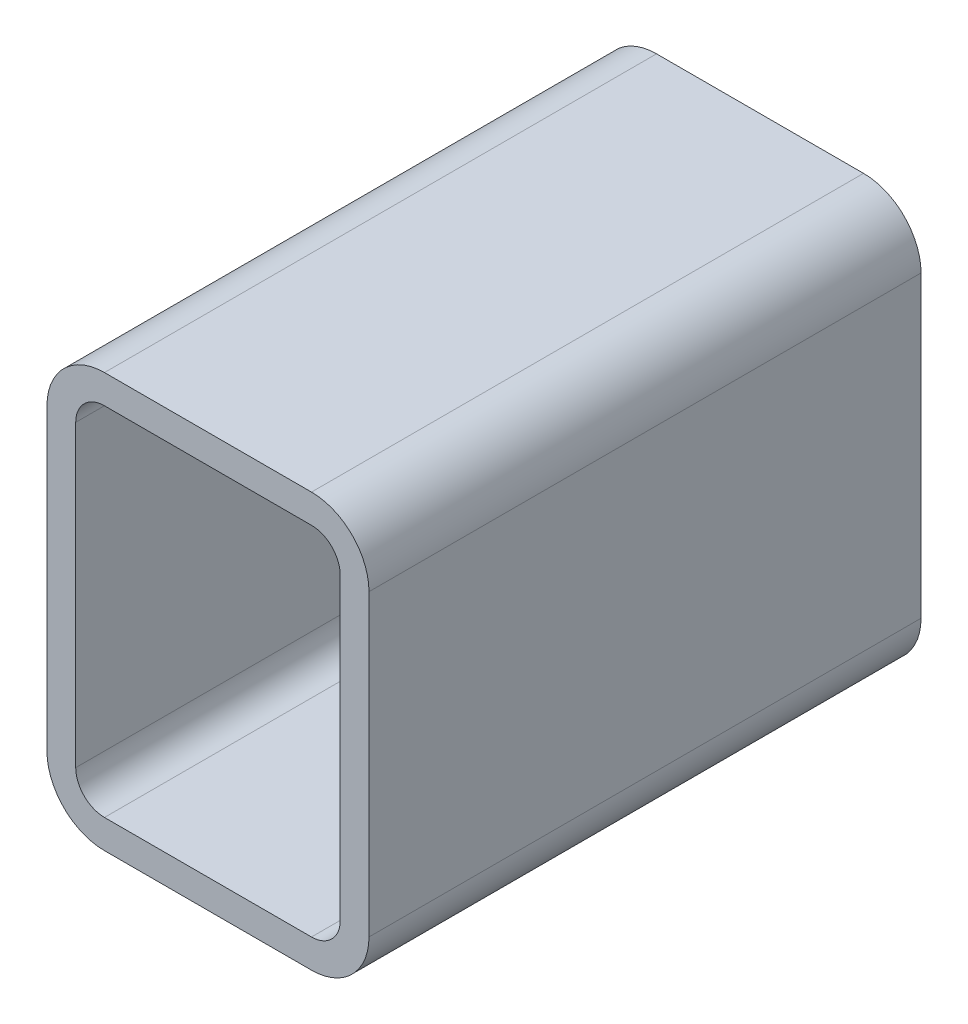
ISO-10303-21;
HEADER;
FILE_DESCRIPTION(('STEP AP214'),'2;1');
FILE_NAME('part.step','',(''),(''),'','','');
FILE_SCHEMA(('AUTOMOTIVE_DESIGN { 1 0 10303 214 1 1 1 1 }'));
ENDSEC;
DATA;
#1=APPLICATION_CONTEXT('core data for automotive mechanical design processes');
#2=APPLICATION_PROTOCOL_DEFINITION('international standard','automotive_design',2000,#1);
#3=PRODUCT_CONTEXT('',#1,'mechanical');
#4=PRODUCT('Part','Part','',(#3));
#5=PRODUCT_RELATED_PRODUCT_CATEGORY('part','',(#4));
#6=PRODUCT_DEFINITION_FORMATION('','',#4);
#7=PRODUCT_DEFINITION_CONTEXT('part definition',#1,'design');
#8=PRODUCT_DEFINITION('design','',#6,#7);
#9=PRODUCT_DEFINITION_SHAPE('','',#8);
#10=(LENGTH_UNIT() NAMED_UNIT(*) SI_UNIT(.MILLI.,.METRE.));
#11=(NAMED_UNIT(*) PLANE_ANGLE_UNIT() SI_UNIT($,.RADIAN.));
#12=(NAMED_UNIT(*) SI_UNIT($,.STERADIAN.) SOLID_ANGLE_UNIT());
#13=UNCERTAINTY_MEASURE_WITH_UNIT(LENGTH_MEASURE(1.E-05),#10,'distance_accuracy_value','');
#14=(GEOMETRIC_REPRESENTATION_CONTEXT(3) GLOBAL_UNCERTAINTY_ASSIGNED_CONTEXT((#13)) GLOBAL_UNIT_ASSIGNED_CONTEXT((#10,
#11,#12)) REPRESENTATION_CONTEXT('',''));
#15=CARTESIAN_POINT('',(0.,0.,0.));
#16=DIRECTION('',(0.,0.,1.));
#17=DIRECTION('',(1.,0.,0.));
#18=AXIS2_PLACEMENT_3D('',#15,#16,#17);
#19=CARTESIAN_POINT('',(33.9548786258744,198.793222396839,304.8));
#20=DIRECTION('',(0.,0.,1.));
#21=DIRECTION('',(1.,0.,0.));
#22=AXIS2_PLACEMENT_3D('',#19,#20,#21);
#23=PLANE('',#22);
#24=CARTESIAN_POINT('',(33.9548786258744,198.793222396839,304.8));
#25=DIRECTION('',(0.,0.,1.));
#26=DIRECTION('',(1.,0.,0.));
#27=AXIS2_PLACEMENT_3D('',#24,#25,#26);
#28=CIRCLE('',#27,31.75);
#29=CARTESIAN_POINT('',(33.9548786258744,230.543222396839,304.8));
#30=VERTEX_POINT('',#29);
#31=CARTESIAN_POINT('',(2.20487862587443,198.793222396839,304.8));
#32=VERTEX_POINT('',#31);
#33=EDGE_CURVE('E211',#30,#32,#28,.T.);
#34=ORIENTED_EDGE('',*,*,#33,.T.);
#35=DIRECTION('',(0.,-1.,0.));
#36=VECTOR('',#35,1.);
#37=CARTESIAN_POINT('',(2.20487862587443,33.6932223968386,304.8));
#38=LINE('',#37,#36);
#39=CARTESIAN_POINT('',(2.20487862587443,33.6932223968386,304.8));
#40=VERTEX_POINT('',#39);
#41=EDGE_CURVE('E214',#32,#40,#38,.T.);
#42=ORIENTED_EDGE('',*,*,#41,.T.);
#43=CARTESIAN_POINT('',(33.9548786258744,33.6932223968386,304.8));
#44=DIRECTION('',(0.,0.,1.));
#45=DIRECTION('',(1.,0.,0.));
#46=AXIS2_PLACEMENT_3D('',#43,#44,#45);
#47=CIRCLE('',#46,31.75);
#48=CARTESIAN_POINT('',(33.9548786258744,1.94322239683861,304.8));
#49=VERTEX_POINT('',#48);
#50=EDGE_CURVE('E217',#40,#49,#47,.T.);
#51=ORIENTED_EDGE('',*,*,#50,.T.);
#52=DIRECTION('',(1.,0.,0.));
#53=VECTOR('',#52,1.);
#54=CARTESIAN_POINT('',(148.254878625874,1.94322239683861,304.8));
#55=LINE('',#54,#53);
#56=CARTESIAN_POINT('',(148.254878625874,1.9432223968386,304.8));
#57=VERTEX_POINT('',#56);
#58=EDGE_CURVE('E219',#49,#57,#55,.T.);
#59=ORIENTED_EDGE('',*,*,#58,.T.);
#60=CARTESIAN_POINT('',(148.254878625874,33.6932223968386,304.8));
#61=DIRECTION('',(0.,0.,1.));
#62=DIRECTION('',(1.,0.,0.));
#63=AXIS2_PLACEMENT_3D('',#60,#61,#62);
#64=CIRCLE('',#63,31.75);
#65=CARTESIAN_POINT('',(180.004878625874,33.6932223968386,304.8));
#66=VERTEX_POINT('',#65);
#67=EDGE_CURVE('E221',#57,#66,#64,.T.);
#68=ORIENTED_EDGE('',*,*,#67,.T.);
#69=DIRECTION('',(0.,1.,0.));
#70=VECTOR('',#69,1.);
#71=CARTESIAN_POINT('',(180.004878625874,198.793222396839,304.8));
#72=LINE('',#71,#70);
#73=CARTESIAN_POINT('',(180.004878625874,198.793222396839,304.8));
#74=VERTEX_POINT('',#73);
#75=EDGE_CURVE('E223',#66,#74,#72,.T.);
#76=ORIENTED_EDGE('',*,*,#75,.T.);
#77=CARTESIAN_POINT('',(148.254878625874,198.793222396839,304.8));
#78=DIRECTION('',(0.,0.,1.));
#79=DIRECTION('',(1.,0.,0.));
#80=AXIS2_PLACEMENT_3D('',#77,#78,#79);
#81=CIRCLE('',#80,31.75);
#82=CARTESIAN_POINT('',(148.254878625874,230.543222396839,304.8));
#83=VERTEX_POINT('',#82);
#84=EDGE_CURVE('E225',#74,#83,#81,.T.);
#85=ORIENTED_EDGE('',*,*,#84,.T.);
#86=DIRECTION('',(-1.,0.,0.));
#87=VECTOR('',#86,1.);
#88=CARTESIAN_POINT('',(33.9548786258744,230.543222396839,304.8));
#89=LINE('',#88,#87);
#90=EDGE_CURVE('E227',#83,#30,#89,.T.);
#91=ORIENTED_EDGE('',*,*,#90,.T.);
#92=EDGE_LOOP('',(#34,#42,#51,#59,#68,#76,#85,#91));
#93=FACE_BOUND('',#92,.T.);
#94=DIRECTION('',(0.,-1.,0.));
#95=VECTOR('',#94,1.);
#96=CARTESIAN_POINT('',(18.0798786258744,33.6932223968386,304.8));
#97=LINE('',#96,#95);
#98=CARTESIAN_POINT('',(18.0798786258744,198.793222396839,304.8));
#99=VERTEX_POINT('',#98);
#100=CARTESIAN_POINT('',(18.0798786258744,33.6932223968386,304.8));
#101=VERTEX_POINT('',#100);
#102=EDGE_CURVE('E154',#99,#101,#97,.T.);
#103=ORIENTED_EDGE('',*,*,#102,.F.);
#104=CARTESIAN_POINT('',(33.9548786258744,198.793222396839,304.8));
#105=DIRECTION('',(0.,0.,1.));
#106=DIRECTION('',(1.,0.,0.));
#107=AXIS2_PLACEMENT_3D('',#104,#105,#106);
#108=CIRCLE('',#107,15.875);
#109=CARTESIAN_POINT('',(33.9548786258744,214.668222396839,304.8));
#110=VERTEX_POINT('',#109);
#111=EDGE_CURVE('E146',#110,#99,#108,.T.);
#112=ORIENTED_EDGE('',*,*,#111,.F.);
#113=DIRECTION('',(-1.,0.,0.));
#114=VECTOR('',#113,1.);
#115=CARTESIAN_POINT('',(33.9548786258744,214.668222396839,304.8));
#116=LINE('',#115,#114);
#117=CARTESIAN_POINT('',(148.254878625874,214.668222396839,304.8));
#118=VERTEX_POINT('',#117);
#119=EDGE_CURVE('E179',#118,#110,#116,.T.);
#120=ORIENTED_EDGE('',*,*,#119,.F.);
#121=CARTESIAN_POINT('',(148.254878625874,198.793222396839,304.8));
#122=DIRECTION('',(0.,0.,1.));
#123=DIRECTION('',(1.,0.,0.));
#124=AXIS2_PLACEMENT_3D('',#121,#122,#123);
#125=CIRCLE('',#124,15.875);
#126=CARTESIAN_POINT('',(164.129878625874,198.793222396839,304.8));
#127=VERTEX_POINT('',#126);
#128=EDGE_CURVE('E177',#127,#118,#125,.T.);
#129=ORIENTED_EDGE('',*,*,#128,.F.);
#130=DIRECTION('',(0.,1.,0.));
#131=VECTOR('',#130,1.);
#132=CARTESIAN_POINT('',(164.129878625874,198.793222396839,304.8));
#133=LINE('',#132,#131);
#134=CARTESIAN_POINT('',(164.129878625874,33.6932223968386,304.8));
#135=VERTEX_POINT('',#134);
#136=EDGE_CURVE('E175',#135,#127,#133,.T.);
#137=ORIENTED_EDGE('',*,*,#136,.F.);
#138=CARTESIAN_POINT('',(148.254878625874,33.6932223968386,304.8));
#139=DIRECTION('',(0.,0.,1.));
#140=DIRECTION('',(1.,0.,0.));
#141=AXIS2_PLACEMENT_3D('',#138,#139,#140);
#142=CIRCLE('',#141,15.875);
#143=CARTESIAN_POINT('',(148.254878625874,17.8182223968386,304.8));
#144=VERTEX_POINT('',#143);
#145=EDGE_CURVE('E173',#144,#135,#142,.T.);
#146=ORIENTED_EDGE('',*,*,#145,.F.);
#147=DIRECTION('',(1.,0.,0.));
#148=VECTOR('',#147,1.);
#149=CARTESIAN_POINT('',(148.254878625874,17.8182223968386,304.8));
#150=LINE('',#149,#148);
#151=CARTESIAN_POINT('',(33.9548786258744,17.8182223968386,304.8));
#152=VERTEX_POINT('',#151);
#153=EDGE_CURVE('E169',#152,#144,#150,.T.);
#154=ORIENTED_EDGE('',*,*,#153,.F.);
#155=CARTESIAN_POINT('',(33.9548786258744,33.6932223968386,304.8));
#156=DIRECTION('',(0.,0.,1.));
#157=DIRECTION('',(1.,0.,0.));
#158=AXIS2_PLACEMENT_3D('',#155,#156,#157);
#159=CIRCLE('',#158,15.875);
#160=EDGE_CURVE('E167',#101,#152,#159,.T.);
#161=ORIENTED_EDGE('',*,*,#160,.F.);
#162=EDGE_LOOP('',(#103,#112,#120,#129,#137,#146,#154,#161));
#163=FACE_BOUND('',#162,.T.);
#164=ADVANCED_FACE('F33',(#93,#163),#23,.T.);
#165=CARTESIAN_POINT('',(33.9548786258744,198.793222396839,0.));
#166=DIRECTION('',(0.,0.,1.));
#167=DIRECTION('',(1.,0.,0.));
#168=AXIS2_PLACEMENT_3D('',#165,#166,#167);
#169=PLANE('',#168);
#170=CARTESIAN_POINT('',(33.9548786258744,198.793222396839,0.));
#171=DIRECTION('',(0.,0.,1.));
#172=DIRECTION('',(1.,0.,0.));
#173=AXIS2_PLACEMENT_3D('',#170,#171,#172);
#174=CIRCLE('',#173,31.75);
#175=CARTESIAN_POINT('',(33.9548786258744,230.543222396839,0.));
#176=VERTEX_POINT('',#175);
#177=CARTESIAN_POINT('',(2.20487862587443,198.793222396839,0.));
#178=VERTEX_POINT('',#177);
#179=EDGE_CURVE('E162',#176,#178,#174,.T.);
#180=ORIENTED_EDGE('',*,*,#179,.F.);
#181=DIRECTION('',(-1.,0.,0.));
#182=VECTOR('',#181,1.);
#183=CARTESIAN_POINT('',(33.9548786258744,230.543222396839,0.));
#184=LINE('',#183,#182);
#185=CARTESIAN_POINT('',(148.254878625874,230.543222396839,0.));
#186=VERTEX_POINT('',#185);
#187=EDGE_CURVE('E215',#186,#176,#184,.T.);
#188=ORIENTED_EDGE('',*,*,#187,.F.);
#189=CARTESIAN_POINT('',(148.254878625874,198.793222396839,0.));
#190=DIRECTION('',(0.,0.,1.));
#191=DIRECTION('',(1.,0.,0.));
#192=AXIS2_PLACEMENT_3D('',#189,#190,#191);
#193=CIRCLE('',#192,31.75);
#194=CARTESIAN_POINT('',(180.004878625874,198.793222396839,0.));
#195=VERTEX_POINT('',#194);
#196=EDGE_CURVE('E242',#195,#186,#193,.T.);
#197=ORIENTED_EDGE('',*,*,#196,.F.);
#198=DIRECTION('',(0.,1.,0.));
#199=VECTOR('',#198,1.);
#200=CARTESIAN_POINT('',(180.004878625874,198.793222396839,0.));
#201=LINE('',#200,#199);
#202=CARTESIAN_POINT('',(180.004878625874,33.6932223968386,0.));
#203=VERTEX_POINT('',#202);
#204=EDGE_CURVE('E240',#203,#195,#201,.T.);
#205=ORIENTED_EDGE('',*,*,#204,.F.);
#206=CARTESIAN_POINT('',(148.254878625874,33.6932223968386,0.));
#207=DIRECTION('',(0.,0.,1.));
#208=DIRECTION('',(1.,0.,0.));
#209=AXIS2_PLACEMENT_3D('',#206,#207,#208);
#210=CIRCLE('',#209,31.75);
#211=CARTESIAN_POINT('',(148.254878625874,1.9432223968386,0.));
#212=VERTEX_POINT('',#211);
#213=EDGE_CURVE('E238',#212,#203,#210,.T.);
#214=ORIENTED_EDGE('',*,*,#213,.F.);
#215=DIRECTION('',(1.,0.,0.));
#216=VECTOR('',#215,1.);
#217=CARTESIAN_POINT('',(148.254878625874,1.94322239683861,0.));
#218=LINE('',#217,#216);
#219=CARTESIAN_POINT('',(33.9548786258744,1.94322239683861,0.));
#220=VERTEX_POINT('',#219);
#221=EDGE_CURVE('E236',#220,#212,#218,.T.);
#222=ORIENTED_EDGE('',*,*,#221,.F.);
#223=CARTESIAN_POINT('',(33.9548786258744,33.6932223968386,0.));
#224=DIRECTION('',(0.,0.,1.));
#225=DIRECTION('',(1.,0.,0.));
#226=AXIS2_PLACEMENT_3D('',#223,#224,#225);
#227=CIRCLE('',#226,31.75);
#228=CARTESIAN_POINT('',(2.20487862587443,33.6932223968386,0.));
#229=VERTEX_POINT('',#228);
#230=EDGE_CURVE('E234',#229,#220,#227,.T.);
#231=ORIENTED_EDGE('',*,*,#230,.F.);
#232=DIRECTION('',(0.,-1.,0.));
#233=VECTOR('',#232,1.);
#234=CARTESIAN_POINT('',(2.20487862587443,33.6932223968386,0.));
#235=LINE('',#234,#233);
#236=EDGE_CURVE('E232',#178,#229,#235,.T.);
#237=ORIENTED_EDGE('',*,*,#236,.F.);
#238=EDGE_LOOP('',(#180,#188,#197,#205,#214,#222,#231,#237));
#239=FACE_BOUND('',#238,.T.);
#240=CARTESIAN_POINT('',(33.9548786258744,198.793222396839,0.));
#241=DIRECTION('',(0.,0.,1.));
#242=DIRECTION('',(1.,0.,0.));
#243=AXIS2_PLACEMENT_3D('',#240,#241,#242);
#244=CIRCLE('',#243,15.875);
#245=CARTESIAN_POINT('',(33.9548786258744,214.668222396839,0.));
#246=VERTEX_POINT('',#245);
#247=CARTESIAN_POINT('',(18.0798786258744,198.793222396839,0.));
#248=VERTEX_POINT('',#247);
#249=EDGE_CURVE('E56',#246,#248,#244,.T.);
#250=ORIENTED_EDGE('',*,*,#249,.T.);
#251=DIRECTION('',(0.,-1.,0.));
#252=VECTOR('',#251,1.);
#253=CARTESIAN_POINT('',(18.0798786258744,33.6932223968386,0.));
#254=LINE('',#253,#252);
#255=CARTESIAN_POINT('',(18.0798786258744,33.6932223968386,0.));
#256=VERTEX_POINT('',#255);
#257=EDGE_CURVE('E161',#248,#256,#254,.T.);
#258=ORIENTED_EDGE('',*,*,#257,.T.);
#259=CARTESIAN_POINT('',(33.9548786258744,33.6932223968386,0.));
#260=DIRECTION('',(0.,0.,1.));
#261=DIRECTION('',(1.,0.,0.));
#262=AXIS2_PLACEMENT_3D('',#259,#260,#261);
#263=CIRCLE('',#262,15.875);
#264=CARTESIAN_POINT('',(33.9548786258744,17.8182223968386,0.));
#265=VERTEX_POINT('',#264);
#266=EDGE_CURVE('E183',#256,#265,#263,.T.);
#267=ORIENTED_EDGE('',*,*,#266,.T.);
#268=DIRECTION('',(1.,0.,0.));
#269=VECTOR('',#268,1.);
#270=CARTESIAN_POINT('',(148.254878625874,17.8182223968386,0.));
#271=LINE('',#270,#269);
#272=CARTESIAN_POINT('',(148.254878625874,17.8182223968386,0.));
#273=VERTEX_POINT('',#272);
#274=EDGE_CURVE('E186',#265,#273,#271,.T.);
#275=ORIENTED_EDGE('',*,*,#274,.T.);
#276=CARTESIAN_POINT('',(148.254878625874,33.6932223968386,0.));
#277=DIRECTION('',(0.,0.,1.));
#278=DIRECTION('',(1.,0.,0.));
#279=AXIS2_PLACEMENT_3D('',#276,#277,#278);
#280=CIRCLE('',#279,15.875);
#281=CARTESIAN_POINT('',(164.129878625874,33.6932223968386,0.));
#282=VERTEX_POINT('',#281);
#283=EDGE_CURVE('E189',#273,#282,#280,.T.);
#284=ORIENTED_EDGE('',*,*,#283,.T.);
#285=DIRECTION('',(0.,1.,0.));
#286=VECTOR('',#285,1.);
#287=CARTESIAN_POINT('',(164.129878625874,198.793222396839,0.));
#288=LINE('',#287,#286);
#289=CARTESIAN_POINT('',(164.129878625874,198.793222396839,0.));
#290=VERTEX_POINT('',#289);
#291=EDGE_CURVE('E192',#282,#290,#288,.T.);
#292=ORIENTED_EDGE('',*,*,#291,.T.);
#293=CARTESIAN_POINT('',(148.254878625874,198.793222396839,0.));
#294=DIRECTION('',(0.,0.,1.));
#295=DIRECTION('',(1.,0.,0.));
#296=AXIS2_PLACEMENT_3D('',#293,#294,#295);
#297=CIRCLE('',#296,15.875);
#298=CARTESIAN_POINT('',(148.254878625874,214.668222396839,0.));
#299=VERTEX_POINT('',#298);
#300=EDGE_CURVE('E195',#290,#299,#297,.T.);
#301=ORIENTED_EDGE('',*,*,#300,.T.);
#302=DIRECTION('',(-1.,0.,0.));
#303=VECTOR('',#302,1.);
#304=CARTESIAN_POINT('',(33.9548786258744,214.668222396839,0.));
#305=LINE('',#304,#303);
#306=EDGE_CURVE('E155',#299,#246,#305,.T.);
#307=ORIENTED_EDGE('',*,*,#306,.T.);
#308=EDGE_LOOP('',(#250,#258,#267,#275,#284,#292,#301,#307));
#309=FACE_BOUND('',#308,.T.);
#310=ADVANCED_FACE('F272',(#239,#309),#169,.F.);
#311=CARTESIAN_POINT('',(33.9548786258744,198.793222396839,304.8));
#312=DIRECTION('',(0.,0.,-1.));
#313=DIRECTION('',(-1.,0.,0.));
#314=AXIS2_PLACEMENT_3D('',#311,#312,#313);
#315=CYLINDRICAL_SURFACE('',#314,31.75);
#316=ORIENTED_EDGE('',*,*,#179,.T.);
#317=DIRECTION('',(0.,0.,-1.));
#318=VECTOR('',#317,1.);
#319=CARTESIAN_POINT('',(2.20487862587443,198.793222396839,304.8));
#320=LINE('',#319,#318);
#321=EDGE_CURVE('E11',#32,#178,#320,.T.);
#322=ORIENTED_EDGE('',*,*,#321,.F.);
#323=ORIENTED_EDGE('',*,*,#33,.F.);
#324=DIRECTION('',(0.,0.,-1.));
#325=VECTOR('',#324,1.);
#326=CARTESIAN_POINT('',(33.9548786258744,230.543222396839,304.8));
#327=LINE('',#326,#325);
#328=EDGE_CURVE('E229',#30,#176,#327,.T.);
#329=ORIENTED_EDGE('',*,*,#328,.T.);
#330=EDGE_LOOP('',(#316,#322,#323,#329));
#331=FACE_BOUND('',#330,.T.);
#332=ADVANCED_FACE('F35',(#331),#315,.T.);
#333=CARTESIAN_POINT('',(2.20487862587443,33.6932223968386,304.8));
#334=DIRECTION('',(1.,0.,0.));
#335=DIRECTION('',(0.,0.,-1.));
#336=AXIS2_PLACEMENT_3D('',#333,#334,#335);
#337=PLANE('',#336);
#338=ORIENTED_EDGE('',*,*,#236,.T.);
#339=DIRECTION('',(0.,0.,-1.));
#340=VECTOR('',#339,1.);
#341=CARTESIAN_POINT('',(2.20487862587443,33.6932223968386,304.8));
#342=LINE('',#341,#340);
#343=EDGE_CURVE('E41',#40,#229,#342,.T.);
#344=ORIENTED_EDGE('',*,*,#343,.F.);
#345=ORIENTED_EDGE('',*,*,#41,.F.);
#346=ORIENTED_EDGE('',*,*,#321,.T.);
#347=EDGE_LOOP('',(#338,#344,#345,#346));
#348=FACE_BOUND('',#347,.T.);
#349=ADVANCED_FACE('F289',(#348),#337,.F.);
#350=CARTESIAN_POINT('',(33.9548786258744,33.6932223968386,304.8));
#351=DIRECTION('',(0.,0.,-1.));
#352=DIRECTION('',(-1.,0.,0.));
#353=AXIS2_PLACEMENT_3D('',#350,#351,#352);
#354=CYLINDRICAL_SURFACE('',#353,31.75);
#355=ORIENTED_EDGE('',*,*,#230,.T.);
#356=DIRECTION('',(0.,0.,-1.));
#357=VECTOR('',#356,1.);
#358=CARTESIAN_POINT('',(33.9548786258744,1.94322239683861,304.8));
#359=LINE('',#358,#357);
#360=EDGE_CURVE('E259',#49,#220,#359,.T.);
#361=ORIENTED_EDGE('',*,*,#360,.F.);
#362=ORIENTED_EDGE('',*,*,#50,.F.);
#363=ORIENTED_EDGE('',*,*,#343,.T.);
#364=EDGE_LOOP('',(#355,#361,#362,#363));
#365=FACE_BOUND('',#364,.T.);
#366=ADVANCED_FACE('F266',(#365),#354,.T.);
#367=CARTESIAN_POINT('',(148.254878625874,1.94322239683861,304.8));
#368=DIRECTION('',(0.,1.,0.));
#369=DIRECTION('',(0.,0.,1.));
#370=AXIS2_PLACEMENT_3D('',#367,#368,#369);
#371=PLANE('',#370);
#372=ORIENTED_EDGE('',*,*,#221,.T.);
#373=DIRECTION('',(0.,0.,-1.));
#374=VECTOR('',#373,1.);
#375=CARTESIAN_POINT('',(148.254878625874,1.9432223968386,304.8));
#376=LINE('',#375,#374);
#377=EDGE_CURVE('E256',#57,#212,#376,.T.);
#378=ORIENTED_EDGE('',*,*,#377,.F.);
#379=ORIENTED_EDGE('',*,*,#58,.F.);
#380=ORIENTED_EDGE('',*,*,#360,.T.);
#381=EDGE_LOOP('',(#372,#378,#379,#380));
#382=FACE_BOUND('',#381,.T.);
#383=ADVANCED_FACE('F278',(#382),#371,.F.);
#384=CARTESIAN_POINT('',(148.254878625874,33.6932223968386,304.8));
#385=DIRECTION('',(0.,0.,-1.));
#386=DIRECTION('',(-1.,0.,0.));
#387=AXIS2_PLACEMENT_3D('',#384,#385,#386);
#388=CYLINDRICAL_SURFACE('',#387,31.75);
#389=ORIENTED_EDGE('',*,*,#213,.T.);
#390=DIRECTION('',(0.,0.,-1.));
#391=VECTOR('',#390,1.);
#392=CARTESIAN_POINT('',(180.004878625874,33.6932223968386,304.8));
#393=LINE('',#392,#391);
#394=EDGE_CURVE('E253',#66,#203,#393,.T.);
#395=ORIENTED_EDGE('',*,*,#394,.F.);
#396=ORIENTED_EDGE('',*,*,#67,.F.);
#397=ORIENTED_EDGE('',*,*,#377,.T.);
#398=EDGE_LOOP('',(#389,#395,#396,#397));
#399=FACE_BOUND('',#398,.T.);
#400=ADVANCED_FACE('F282',(#399),#388,.T.);
#401=CARTESIAN_POINT('',(180.004878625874,198.793222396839,304.8));
#402=DIRECTION('',(-1.,0.,0.));
#403=DIRECTION('',(0.,0.,1.));
#404=AXIS2_PLACEMENT_3D('',#401,#402,#403);
#405=PLANE('',#404);
#406=ORIENTED_EDGE('',*,*,#204,.T.);
#407=DIRECTION('',(0.,0.,-1.));
#408=VECTOR('',#407,1.);
#409=CARTESIAN_POINT('',(180.004878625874,198.793222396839,304.8));
#410=LINE('',#409,#408);
#411=EDGE_CURVE('E250',#74,#195,#410,.T.);
#412=ORIENTED_EDGE('',*,*,#411,.F.);
#413=ORIENTED_EDGE('',*,*,#75,.F.);
#414=ORIENTED_EDGE('',*,*,#394,.T.);
#415=EDGE_LOOP('',(#406,#412,#413,#414));
#416=FACE_BOUND('',#415,.T.);
#417=ADVANCED_FACE('F302',(#416),#405,.F.);
#418=CARTESIAN_POINT('',(148.254878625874,198.793222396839,304.8));
#419=DIRECTION('',(0.,0.,-1.));
#420=DIRECTION('',(-1.,0.,0.));
#421=AXIS2_PLACEMENT_3D('',#418,#419,#420);
#422=CYLINDRICAL_SURFACE('',#421,31.75);
#423=ORIENTED_EDGE('',*,*,#196,.T.);
#424=DIRECTION('',(0.,0.,-1.));
#425=VECTOR('',#424,1.);
#426=CARTESIAN_POINT('',(148.254878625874,230.543222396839,304.8));
#427=LINE('',#426,#425);
#428=EDGE_CURVE('E247',#83,#186,#427,.T.);
#429=ORIENTED_EDGE('',*,*,#428,.F.);
#430=ORIENTED_EDGE('',*,*,#84,.F.);
#431=ORIENTED_EDGE('',*,*,#411,.T.);
#432=EDGE_LOOP('',(#423,#429,#430,#431));
#433=FACE_BOUND('',#432,.T.);
#434=ADVANCED_FACE('F300',(#433),#422,.T.);
#435=CARTESIAN_POINT('',(33.9548786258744,230.543222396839,304.8));
#436=DIRECTION('',(0.,-1.,0.));
#437=DIRECTION('',(0.,0.,-1.));
#438=AXIS2_PLACEMENT_3D('',#435,#436,#437);
#439=PLANE('',#438);
#440=ORIENTED_EDGE('',*,*,#187,.T.);
#441=ORIENTED_EDGE('',*,*,#328,.F.);
#442=ORIENTED_EDGE('',*,*,#90,.F.);
#443=ORIENTED_EDGE('',*,*,#428,.T.);
#444=EDGE_LOOP('',(#440,#441,#442,#443));
#445=FACE_BOUND('',#444,.T.);
#446=ADVANCED_FACE('F295',(#445),#439,.F.);
#447=CARTESIAN_POINT('',(33.9548786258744,198.793222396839,304.8));
#448=DIRECTION('',(0.,0.,-1.));
#449=DIRECTION('',(-1.,0.,0.));
#450=AXIS2_PLACEMENT_3D('',#447,#448,#449);
#451=CYLINDRICAL_SURFACE('',#450,15.875);
#452=ORIENTED_EDGE('',*,*,#249,.F.);
#453=DIRECTION('',(0.,0.,-1.));
#454=VECTOR('',#453,1.);
#455=CARTESIAN_POINT('',(33.9548786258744,214.668222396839,304.8));
#456=LINE('',#455,#454);
#457=EDGE_CURVE('E150',#110,#246,#456,.T.);
#458=ORIENTED_EDGE('',*,*,#457,.F.);
#459=ORIENTED_EDGE('',*,*,#111,.T.);
#460=DIRECTION('',(0.,0.,-1.));
#461=VECTOR('',#460,1.);
#462=CARTESIAN_POINT('',(18.0798786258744,198.793222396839,304.8));
#463=LINE('',#462,#461);
#464=EDGE_CURVE('E149',#99,#248,#463,.T.);
#465=ORIENTED_EDGE('',*,*,#464,.T.);
#466=EDGE_LOOP('',(#452,#458,#459,#465));
#467=FACE_BOUND('',#466,.T.);
#468=ADVANCED_FACE('F148',(#467),#451,.F.);
#469=CARTESIAN_POINT('',(18.0798786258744,33.6932223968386,304.8));
#470=DIRECTION('',(1.,0.,0.));
#471=DIRECTION('',(0.,0.,-1.));
#472=AXIS2_PLACEMENT_3D('',#469,#470,#471);
#473=PLANE('',#472);
#474=ORIENTED_EDGE('',*,*,#257,.F.);
#475=ORIENTED_EDGE('',*,*,#464,.F.);
#476=ORIENTED_EDGE('',*,*,#102,.T.);
#477=DIRECTION('',(0.,0.,-1.));
#478=VECTOR('',#477,1.);
#479=CARTESIAN_POINT('',(18.0798786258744,33.6932223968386,304.8));
#480=LINE('',#479,#478);
#481=EDGE_CURVE('E163',#101,#256,#480,.T.);
#482=ORIENTED_EDGE('',*,*,#481,.T.);
#483=EDGE_LOOP('',(#474,#475,#476,#482));
#484=FACE_BOUND('',#483,.T.);
#485=ADVANCED_FACE('F158',(#484),#473,.T.);
#486=CARTESIAN_POINT('',(33.9548786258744,33.6932223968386,304.8));
#487=DIRECTION('',(0.,0.,-1.));
#488=DIRECTION('',(-1.,0.,0.));
#489=AXIS2_PLACEMENT_3D('',#486,#487,#488);
#490=CYLINDRICAL_SURFACE('',#489,15.875);
#491=ORIENTED_EDGE('',*,*,#266,.F.);
#492=ORIENTED_EDGE('',*,*,#481,.F.);
#493=ORIENTED_EDGE('',*,*,#160,.T.);
#494=DIRECTION('',(0.,0.,-1.));
#495=VECTOR('',#494,1.);
#496=CARTESIAN_POINT('',(33.9548786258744,17.8182223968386,304.8));
#497=LINE('',#496,#495);
#498=EDGE_CURVE('E208',#152,#265,#497,.T.);
#499=ORIENTED_EDGE('',*,*,#498,.T.);
#500=EDGE_LOOP('',(#491,#492,#493,#499));
#501=FACE_BOUND('',#500,.T.);
#502=ADVANCED_FACE('F327',(#501),#490,.F.);
#503=CARTESIAN_POINT('',(148.254878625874,17.8182223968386,304.8));
#504=DIRECTION('',(0.,1.,0.));
#505=DIRECTION('',(0.,0.,1.));
#506=AXIS2_PLACEMENT_3D('',#503,#504,#505);
#507=PLANE('',#506);
#508=ORIENTED_EDGE('',*,*,#274,.F.);
#509=ORIENTED_EDGE('',*,*,#498,.F.);
#510=ORIENTED_EDGE('',*,*,#153,.T.);
#511=DIRECTION('',(0.,0.,-1.));
#512=VECTOR('',#511,1.);
#513=CARTESIAN_POINT('',(148.254878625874,17.8182223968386,304.8));
#514=LINE('',#513,#512);
#515=EDGE_CURVE('E206',#144,#273,#514,.T.);
#516=ORIENTED_EDGE('',*,*,#515,.T.);
#517=EDGE_LOOP('',(#508,#509,#510,#516));
#518=FACE_BOUND('',#517,.T.);
#519=ADVANCED_FACE('F331',(#518),#507,.T.);
#520=CARTESIAN_POINT('',(148.254878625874,33.6932223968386,304.8));
#521=DIRECTION('',(0.,0.,-1.));
#522=DIRECTION('',(-1.,0.,0.));
#523=AXIS2_PLACEMENT_3D('',#520,#521,#522);
#524=CYLINDRICAL_SURFACE('',#523,15.875);
#525=ORIENTED_EDGE('',*,*,#283,.F.);
#526=ORIENTED_EDGE('',*,*,#515,.F.);
#527=ORIENTED_EDGE('',*,*,#145,.T.);
#528=DIRECTION('',(0.,0.,-1.));
#529=VECTOR('',#528,1.);
#530=CARTESIAN_POINT('',(164.129878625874,33.6932223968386,304.8));
#531=LINE('',#530,#529);
#532=EDGE_CURVE('E204',#135,#282,#531,.T.);
#533=ORIENTED_EDGE('',*,*,#532,.T.);
#534=EDGE_LOOP('',(#525,#526,#527,#533));
#535=FACE_BOUND('',#534,.T.);
#536=ADVANCED_FACE('F337',(#535),#524,.F.);
#537=CARTESIAN_POINT('',(164.129878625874,198.793222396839,304.8));
#538=DIRECTION('',(-1.,0.,0.));
#539=DIRECTION('',(0.,0.,1.));
#540=AXIS2_PLACEMENT_3D('',#537,#538,#539);
#541=PLANE('',#540);
#542=ORIENTED_EDGE('',*,*,#291,.F.);
#543=ORIENTED_EDGE('',*,*,#532,.F.);
#544=ORIENTED_EDGE('',*,*,#136,.T.);
#545=DIRECTION('',(0.,0.,-1.));
#546=VECTOR('',#545,1.);
#547=CARTESIAN_POINT('',(164.129878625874,198.793222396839,304.8));
#548=LINE('',#547,#546);
#549=EDGE_CURVE('E202',#127,#290,#548,.T.);
#550=ORIENTED_EDGE('',*,*,#549,.T.);
#551=EDGE_LOOP('',(#542,#543,#544,#550));
#552=FACE_BOUND('',#551,.T.);
#553=ADVANCED_FACE('F341',(#552),#541,.T.);
#554=CARTESIAN_POINT('',(148.254878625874,198.793222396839,304.8));
#555=DIRECTION('',(0.,0.,-1.));
#556=DIRECTION('',(-1.,0.,0.));
#557=AXIS2_PLACEMENT_3D('',#554,#555,#556);
#558=CYLINDRICAL_SURFACE('',#557,15.875);
#559=ORIENTED_EDGE('',*,*,#300,.F.);
#560=ORIENTED_EDGE('',*,*,#549,.F.);
#561=ORIENTED_EDGE('',*,*,#128,.T.);
#562=DIRECTION('',(0.,0.,-1.));
#563=VECTOR('',#562,1.);
#564=CARTESIAN_POINT('',(148.254878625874,214.668222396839,304.8));
#565=LINE('',#564,#563);
#566=EDGE_CURVE('E48',#118,#299,#565,.T.);
#567=ORIENTED_EDGE('',*,*,#566,.T.);
#568=EDGE_LOOP('',(#559,#560,#561,#567));
#569=FACE_BOUND('',#568,.T.);
#570=ADVANCED_FACE('F345',(#569),#558,.F.);
#571=CARTESIAN_POINT('',(33.9548786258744,214.668222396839,304.8));
#572=DIRECTION('',(0.,-1.,0.));
#573=DIRECTION('',(0.,0.,-1.));
#574=AXIS2_PLACEMENT_3D('',#571,#572,#573);
#575=PLANE('',#574);
#576=ORIENTED_EDGE('',*,*,#306,.F.);
#577=ORIENTED_EDGE('',*,*,#566,.F.);
#578=ORIENTED_EDGE('',*,*,#119,.T.);
#579=ORIENTED_EDGE('',*,*,#457,.T.);
#580=EDGE_LOOP('',(#576,#577,#578,#579));
#581=FACE_BOUND('',#580,.T.);
#582=ADVANCED_FACE('F349',(#581),#575,.T.);
#583=CLOSED_SHELL('',(#164,#310,#332,#349,#366,#383,#400,#417,#434,#446,#468,#485,#502,#519,
#536,#553,#570,#582));
#584=MANIFOLD_SOLID_BREP('B2',#583);
#585=ADVANCED_BREP_SHAPE_REPRESENTATION('',(#18,#584),#14);
#586=SHAPE_DEFINITION_REPRESENTATION(#9,#585);
ENDSEC;
END-ISO-10303-21;
